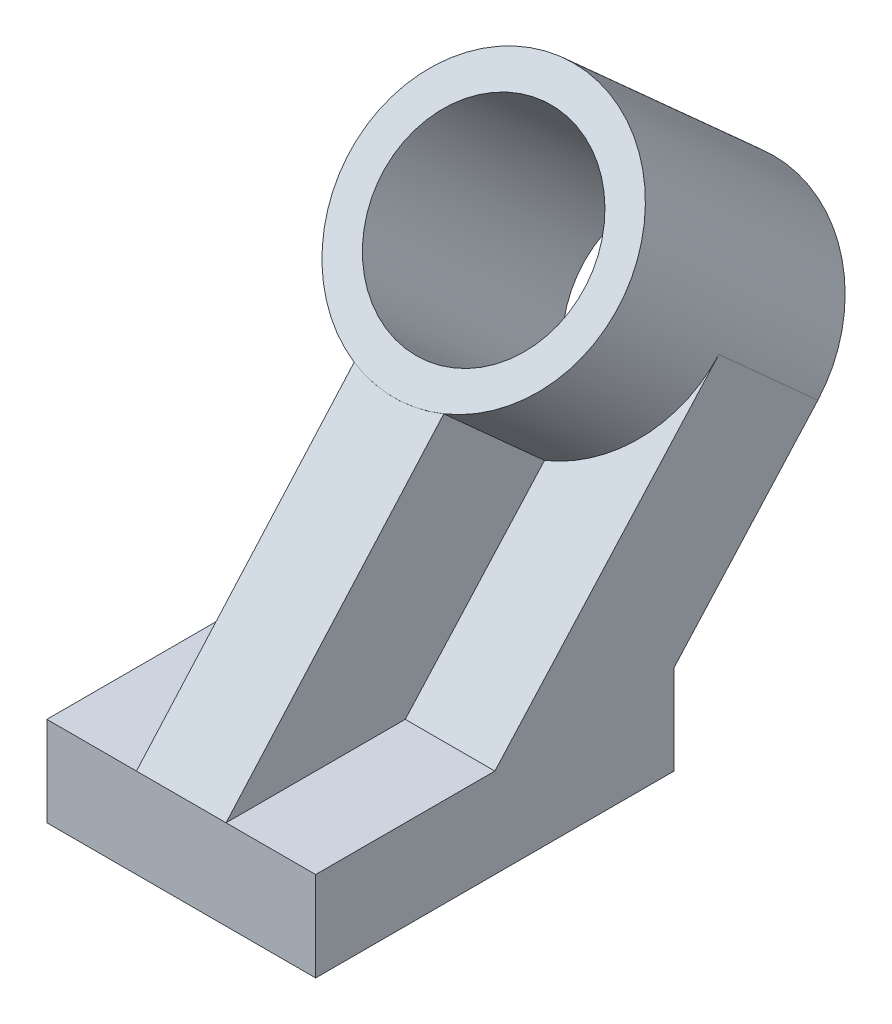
from build123d import *

# Parameters (mm, degrees)
BOSS_EXTRUDE1_DEPTH = 38.1
SKETCH3_R           = 38.1
BOSS_EXTRUDE2_DEPTH = 76.2
SKETCH4_R           = 28.575
CUT_EXTRUDE1_DEPTH  = 231.8469362
RIB23_REACH         = 230.285
SKETCH9_WALL_W      = 558.88941382
SKETCH9_WALL_H      = 25.4


with BuildPart() as part:
    # Sketch1 → Boss-Extrude1 (new, symmetric)
    with BuildSketch(Plane(origin=(0, 0, 0), x_dir=(0, 0, -1), z_dir=(1, 0, 0))):
        Polygon((0, 0), (0, 25.4), (50.8, 25.4), (114.3, 95.923894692), (142.355022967, 70.663038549), (101.6, 25.4), (101.6, 0), align=None)
    extrude(amount=BOSS_EXTRUDE1_DEPTH, both=True)

    # Sketch3 → Boss-Extrude2 (add)
    with BuildSketch(Plane(origin=(0, -39.149223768, -43.479617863), x_dir=(-1, 0, 0), z_dir=(0, -0.6691306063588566, -0.7431448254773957))):
        with Locations(Location((0, 147.766974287, 0), (0, 0, 90))):
            Circle(SKETCH3_R)
    extrude(amount=-BOSS_EXTRUDE2_DEPTH)

    # Sketch4 → Cut-Extrude1 (cut, through all)
    with BuildSketch(Plane(origin=(0, 11.838528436, 13.148017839), x_dir=(1, 0, 0), z_dir=(0, 0.6691306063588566, 0.7431448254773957))):
        with Locations(Location((0, 147.766974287, 0), (0, 0, 270))):
            Circle(SKETCH4_R)
    extrude(amount=-CUT_EXTRUDE1_DEPTH, mode=Mode.SUBTRACT)

    # Sketch9 wall → Rib23 (add, up to next)
    with BuildSketch(Plane(origin=(0, 62.907713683, -33.303490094), x_dir=(0, -0.747772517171, 0.663955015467), z_dir=(0, 0.663955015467, 0.747772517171)), mode=Mode.PRIVATE) as rib23_sk1:
        Rectangle(SKETCH9_WALL_W, SKETCH9_WALL_H)
    rib23_tool1 = extrude(rib23_sk1.sketch, amount=-RIB23_REACH, mode=Mode.PRIVATE) - part.part
    add(rib23_tool1.solids().sort_by_distance((0, 62.907713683, -33.303490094))[0])


solid = part.part
